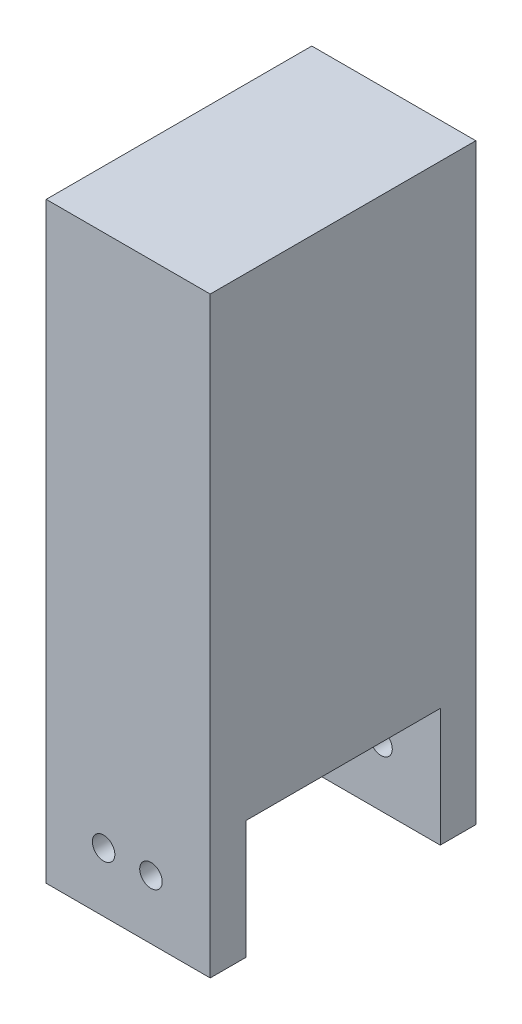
ISO-10303-21;
HEADER;
FILE_DESCRIPTION(('STEP AP214'),'2;1');
FILE_NAME('part.step','',(''),(''),'','','');
FILE_SCHEMA(('AUTOMOTIVE_DESIGN { 1 0 10303 214 1 1 1 1 }'));
ENDSEC;
DATA;
#1=APPLICATION_CONTEXT('core data for automotive mechanical design processes');
#2=APPLICATION_PROTOCOL_DEFINITION('international standard','automotive_design',2000,#1);
#3=PRODUCT_CONTEXT('',#1,'mechanical');
#4=PRODUCT('Part','Part','',(#3));
#5=PRODUCT_RELATED_PRODUCT_CATEGORY('part','',(#4));
#6=PRODUCT_DEFINITION_FORMATION('','',#4);
#7=PRODUCT_DEFINITION_CONTEXT('part definition',#1,'design');
#8=PRODUCT_DEFINITION('design','',#6,#7);
#9=PRODUCT_DEFINITION_SHAPE('','',#8);
#10=(LENGTH_UNIT() NAMED_UNIT(*) SI_UNIT(.MILLI.,.METRE.));
#11=(NAMED_UNIT(*) PLANE_ANGLE_UNIT() SI_UNIT($,.RADIAN.));
#12=(NAMED_UNIT(*) SI_UNIT($,.STERADIAN.) SOLID_ANGLE_UNIT());
#13=UNCERTAINTY_MEASURE_WITH_UNIT(LENGTH_MEASURE(1.E-05),#10,'distance_accuracy_value','');
#14=(GEOMETRIC_REPRESENTATION_CONTEXT(3) GLOBAL_UNCERTAINTY_ASSIGNED_CONTEXT((#13)) GLOBAL_UNIT_ASSIGNED_CONTEXT((#10,
#11,#12)) REPRESENTATION_CONTEXT('',''));
#15=CARTESIAN_POINT('',(0.,0.,0.));
#16=DIRECTION('',(0.,0.,1.));
#17=DIRECTION('',(1.,0.,0.));
#18=AXIS2_PLACEMENT_3D('',#15,#16,#17);
#19=CARTESIAN_POINT('',(0.,0.,0.));
#20=DIRECTION('',(0.,0.,1.));
#21=DIRECTION('',(1.,0.,0.));
#22=AXIS2_PLACEMENT_3D('',#19,#20,#21);
#23=PLANE('',#22);
#24=CARTESIAN_POINT('',(15.0000000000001,5.00000000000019,0.));
#25=DIRECTION('',(0.,0.,1.));
#26=DIRECTION('',(1.,0.,0.));
#27=AXIS2_PLACEMENT_3D('',#24,#25,#26);
#28=CIRCLE('',#27,0.950000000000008);
#29=CARTESIAN_POINT('',(15.9500000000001,5.00000000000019,0.));
#30=VERTEX_POINT('',#29);
#31=EDGE_CURVE('E149',#30,#30,#28,.T.);
#32=ORIENTED_EDGE('',*,*,#31,.T.);
#33=EDGE_LOOP('',(#32));
#34=FACE_BOUND('',#33,.T.);
#35=CARTESIAN_POINT('',(19.0000000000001,5.00000000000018,0.));
#36=DIRECTION('',(0.,0.,1.));
#37=DIRECTION('',(1.,0.,0.));
#38=AXIS2_PLACEMENT_3D('',#35,#36,#37);
#39=CIRCLE('',#38,0.950000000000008);
#40=CARTESIAN_POINT('',(19.9500000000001,5.00000000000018,0.));
#41=VERTEX_POINT('',#40);
#42=EDGE_CURVE('E161',#41,#41,#39,.T.);
#43=ORIENTED_EDGE('',*,*,#42,.T.);
#44=EDGE_LOOP('',(#43));
#45=FACE_BOUND('',#44,.T.);
#46=DIRECTION('',(-1.,0.,0.));
#47=VECTOR('',#46,1.);
#48=CARTESIAN_POINT('',(24.0000000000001,10.0000000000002,0.));
#49=LINE('',#48,#47);
#50=CARTESIAN_POINT('',(24.0000000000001,10.0000000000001,0.));
#51=VERTEX_POINT('',#50);
#52=CARTESIAN_POINT('',(10.1543483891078,10.0000000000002,0.));
#53=VERTEX_POINT('',#52);
#54=EDGE_CURVE('E49',#51,#53,#49,.T.);
#55=ORIENTED_EDGE('',*,*,#54,.F.);
#56=DIRECTION('',(0.,1.,0.));
#57=VECTOR('',#56,1.);
#58=CARTESIAN_POINT('',(24.0000000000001,1.36420711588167E-13,0.));
#59=LINE('',#58,#57);
#60=CARTESIAN_POINT('',(24.0000000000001,1.36420711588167E-13,0.));
#61=VERTEX_POINT('',#60);
#62=EDGE_CURVE('E167',#61,#51,#59,.T.);
#63=ORIENTED_EDGE('',*,*,#62,.F.);
#64=DIRECTION('',(1.,0.,0.));
#65=VECTOR('',#64,1.);
#66=CARTESIAN_POINT('',(24.0000000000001,1.36420711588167E-13,0.));
#67=LINE('',#66,#65);
#68=CARTESIAN_POINT('',(10.1543483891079,1.36420711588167E-13,0.));
#69=VERTEX_POINT('',#68);
#70=EDGE_CURVE('E73',#69,#61,#67,.T.);
#71=ORIENTED_EDGE('',*,*,#70,.F.);
#72=DIRECTION('',(0.,-1.,0.));
#73=VECTOR('',#72,1.);
#74=CARTESIAN_POINT('',(10.1543483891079,1.36420711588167E-13,0.));
#75=LINE('',#74,#73);
#76=EDGE_CURVE('E178',#53,#69,#75,.T.);
#77=ORIENTED_EDGE('',*,*,#76,.F.);
#78=EDGE_LOOP('',(#55,#63,#71,#77));
#79=FACE_BOUND('',#78,.T.);
#80=ADVANCED_FACE('F34',(#34,#45,#79),#23,.F.);
#81=CARTESIAN_POINT('',(0.,0.,3.));
#82=DIRECTION('',(0.,0.,1.));
#83=DIRECTION('',(1.,0.,0.));
#84=AXIS2_PLACEMENT_3D('',#81,#82,#83);
#85=PLANE('',#84);
#86=CARTESIAN_POINT('',(19.0000000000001,5.00000000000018,3.));
#87=DIRECTION('',(0.,0.,1.));
#88=DIRECTION('',(1.,0.,0.));
#89=AXIS2_PLACEMENT_3D('',#86,#87,#88);
#90=CIRCLE('',#89,0.950000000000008);
#91=CARTESIAN_POINT('',(19.9500000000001,5.00000000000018,3.));
#92=VERTEX_POINT('',#91);
#93=EDGE_CURVE('E164',#92,#92,#90,.T.);
#94=ORIENTED_EDGE('',*,*,#93,.F.);
#95=EDGE_LOOP('',(#94));
#96=FACE_BOUND('',#95,.T.);
#97=DIRECTION('',(0.,1.,0.));
#98=VECTOR('',#97,1.);
#99=CARTESIAN_POINT('',(24.0000000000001,1.36420711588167E-13,3.));
#100=LINE('',#99,#98);
#101=CARTESIAN_POINT('',(24.0000000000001,1.36420711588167E-13,3.));
#102=VERTEX_POINT('',#101);
#103=CARTESIAN_POINT('',(24.0000000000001,50.,3.));
#104=VERTEX_POINT('',#103);
#105=EDGE_CURVE('E170',#102,#104,#100,.T.);
#106=ORIENTED_EDGE('',*,*,#105,.T.);
#107=DIRECTION('',(-1.,0.,0.));
#108=VECTOR('',#107,1.);
#109=CARTESIAN_POINT('',(24.0000000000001,50.,3.));
#110=LINE('',#109,#108);
#111=CARTESIAN_POINT('',(10.1543483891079,50.,3.));
#112=VERTEX_POINT('',#111);
#113=EDGE_CURVE('E80',#104,#112,#110,.T.);
#114=ORIENTED_EDGE('',*,*,#113,.T.);
#115=DIRECTION('',(0.,-1.,0.));
#116=VECTOR('',#115,1.);
#117=CARTESIAN_POINT('',(10.1543483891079,1.36420711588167E-13,3.));
#118=LINE('',#117,#116);
#119=CARTESIAN_POINT('',(10.1543483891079,1.36420711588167E-13,3.));
#120=VERTEX_POINT('',#119);
#121=EDGE_CURVE('E173',#112,#120,#118,.T.);
#122=ORIENTED_EDGE('',*,*,#121,.T.);
#123=DIRECTION('',(1.,0.,0.));
#124=VECTOR('',#123,1.);
#125=CARTESIAN_POINT('',(24.0000000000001,1.36420711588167E-13,3.));
#126=LINE('',#125,#124);
#127=EDGE_CURVE('E58',#120,#102,#126,.T.);
#128=ORIENTED_EDGE('',*,*,#127,.T.);
#129=EDGE_LOOP('',(#106,#114,#122,#128));
#130=FACE_BOUND('',#129,.T.);
#131=CARTESIAN_POINT('',(15.0000000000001,5.00000000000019,3.));
#132=DIRECTION('',(0.,0.,1.));
#133=DIRECTION('',(1.,0.,0.));
#134=AXIS2_PLACEMENT_3D('',#131,#132,#133);
#135=CIRCLE('',#134,0.950000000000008);
#136=CARTESIAN_POINT('',(15.9500000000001,5.00000000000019,3.));
#137=VERTEX_POINT('',#136);
#138=EDGE_CURVE('E158',#137,#137,#135,.T.);
#139=ORIENTED_EDGE('',*,*,#138,.F.);
#140=EDGE_LOOP('',(#139));
#141=FACE_BOUND('',#140,.T.);
#142=ADVANCED_FACE('F187',(#96,#130,#141),#85,.T.);
#143=CARTESIAN_POINT('',(24.0000000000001,1.36420711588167E-13,3.));
#144=DIRECTION('',(-1.,0.,0.));
#145=DIRECTION('',(0.,0.,1.));
#146=AXIS2_PLACEMENT_3D('',#143,#144,#145);
#147=PLANE('',#146);
#148=ORIENTED_EDGE('',*,*,#62,.T.);
#149=DIRECTION('',(0.,0.,1.));
#150=VECTOR('',#149,1.);
#151=CARTESIAN_POINT('',(24.0000000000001,10.0000000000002,-19.422));
#152=LINE('',#151,#150);
#153=CARTESIAN_POINT('',(24.0000000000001,10.0000000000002,-16.42));
#154=VERTEX_POINT('',#153);
#155=EDGE_CURVE('E151',#154,#51,#152,.T.);
#156=ORIENTED_EDGE('',*,*,#155,.F.);
#157=DIRECTION('',(0.,1.,0.));
#158=VECTOR('',#157,1.);
#159=CARTESIAN_POINT('',(24.0000000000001,1.36420711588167E-13,-16.42));
#160=LINE('',#159,#158);
#161=CARTESIAN_POINT('',(24.0000000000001,1.36420711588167E-13,-16.42));
#162=VERTEX_POINT('',#161);
#163=EDGE_CURVE('E138',#162,#154,#160,.T.);
#164=ORIENTED_EDGE('',*,*,#163,.F.);
#165=DIRECTION('',(0.,0.,1.));
#166=VECTOR('',#165,1.);
#167=CARTESIAN_POINT('',(24.0000000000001,1.36420711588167E-13,-19.42));
#168=LINE('',#167,#166);
#169=CARTESIAN_POINT('',(24.0000000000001,1.36420711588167E-13,-19.42));
#170=VERTEX_POINT('',#169);
#171=EDGE_CURVE('E124',#170,#162,#168,.T.);
#172=ORIENTED_EDGE('',*,*,#171,.F.);
#173=DIRECTION('',(0.,1.,0.));
#174=VECTOR('',#173,1.);
#175=CARTESIAN_POINT('',(24.0000000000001,1.36420711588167E-13,-19.42));
#176=LINE('',#175,#174);
#177=CARTESIAN_POINT('',(24.0000000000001,50.,-19.42));
#178=VERTEX_POINT('',#177);
#179=EDGE_CURVE('E119',#170,#178,#176,.T.);
#180=ORIENTED_EDGE('',*,*,#179,.T.);
#181=DIRECTION('',(0.,0.,-1.));
#182=VECTOR('',#181,1.);
#183=CARTESIAN_POINT('',(24.0000000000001,50.,3.));
#184=LINE('',#183,#182);
#185=EDGE_CURVE('E11',#104,#178,#184,.T.);
#186=ORIENTED_EDGE('',*,*,#185,.F.);
#187=ORIENTED_EDGE('',*,*,#105,.F.);
#188=DIRECTION('',(0.,0.,-1.));
#189=VECTOR('',#188,1.);
#190=CARTESIAN_POINT('',(24.0000000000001,1.36420711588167E-13,3.));
#191=LINE('',#190,#189);
#192=EDGE_CURVE('E176',#102,#61,#191,.T.);
#193=ORIENTED_EDGE('',*,*,#192,.T.);
#194=EDGE_LOOP('',(#148,#156,#164,#172,#180,#186,#187,#193));
#195=FACE_BOUND('',#194,.T.);
#196=ADVANCED_FACE('F36',(#195),#147,.F.);
#197=CARTESIAN_POINT('',(24.0000000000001,50.,3.));
#198=DIRECTION('',(0.,-1.,0.));
#199=DIRECTION('',(0.,0.,-1.));
#200=AXIS2_PLACEMENT_3D('',#197,#198,#199);
#201=PLANE('',#200);
#202=ORIENTED_EDGE('',*,*,#185,.T.);
#203=DIRECTION('',(-1.,0.,0.));
#204=VECTOR('',#203,1.);
#205=CARTESIAN_POINT('',(24.0000000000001,50.,-19.42));
#206=LINE('',#205,#204);
#207=CARTESIAN_POINT('',(10.1543483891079,50.,-19.42));
#208=VERTEX_POINT('',#207);
#209=EDGE_CURVE('E109',#178,#208,#206,.T.);
#210=ORIENTED_EDGE('',*,*,#209,.T.);
#211=DIRECTION('',(0.,0.,-1.));
#212=VECTOR('',#211,1.);
#213=CARTESIAN_POINT('',(10.1543483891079,50.,3.));
#214=LINE('',#213,#212);
#215=EDGE_CURVE('E42',#112,#208,#214,.T.);
#216=ORIENTED_EDGE('',*,*,#215,.F.);
#217=ORIENTED_EDGE('',*,*,#113,.F.);
#218=EDGE_LOOP('',(#202,#210,#216,#217));
#219=FACE_BOUND('',#218,.T.);
#220=ADVANCED_FACE('F108',(#219),#201,.F.);
#221=CARTESIAN_POINT('',(10.1543483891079,1.36420711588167E-13,3.));
#222=DIRECTION('',(1.,0.,0.));
#223=DIRECTION('',(0.,0.,-1.));
#224=AXIS2_PLACEMENT_3D('',#221,#222,#223);
#225=PLANE('',#224);
#226=ORIENTED_EDGE('',*,*,#215,.T.);
#227=DIRECTION('',(0.,-1.,0.));
#228=VECTOR('',#227,1.);
#229=CARTESIAN_POINT('',(10.1543483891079,1.36420711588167E-13,-19.42));
#230=LINE('',#229,#228);
#231=CARTESIAN_POINT('',(10.1543483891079,1.36420711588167E-13,-19.42));
#232=VERTEX_POINT('',#231);
#233=EDGE_CURVE('E121',#208,#232,#230,.T.);
#234=ORIENTED_EDGE('',*,*,#233,.T.);
#235=DIRECTION('',(0.,0.,1.));
#236=VECTOR('',#235,1.);
#237=CARTESIAN_POINT('',(10.1543483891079,1.36420711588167E-13,-19.42));
#238=LINE('',#237,#236);
#239=CARTESIAN_POINT('',(10.1543483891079,1.36420711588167E-13,-16.42));
#240=VERTEX_POINT('',#239);
#241=EDGE_CURVE('E144',#232,#240,#238,.T.);
#242=ORIENTED_EDGE('',*,*,#241,.T.);
#243=DIRECTION('',(0.,-1.,0.));
#244=VECTOR('',#243,1.);
#245=CARTESIAN_POINT('',(10.1543483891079,1.36420711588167E-13,-16.42));
#246=LINE('',#245,#244);
#247=CARTESIAN_POINT('',(10.1543483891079,10.0000000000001,-16.42));
#248=VERTEX_POINT('',#247);
#249=EDGE_CURVE('E129',#248,#240,#246,.T.);
#250=ORIENTED_EDGE('',*,*,#249,.F.);
#251=DIRECTION('',(0.,0.,1.));
#252=VECTOR('',#251,1.);
#253=CARTESIAN_POINT('',(10.1543483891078,10.0000000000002,-19.422));
#254=LINE('',#253,#252);
#255=EDGE_CURVE('E150',#248,#53,#254,.T.);
#256=ORIENTED_EDGE('',*,*,#255,.T.);
#257=ORIENTED_EDGE('',*,*,#76,.T.);
#258=DIRECTION('',(0.,0.,-1.));
#259=VECTOR('',#258,1.);
#260=CARTESIAN_POINT('',(10.1543483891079,1.36420711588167E-13,3.));
#261=LINE('',#260,#259);
#262=EDGE_CURVE('E182',#120,#69,#261,.T.);
#263=ORIENTED_EDGE('',*,*,#262,.F.);
#264=ORIENTED_EDGE('',*,*,#121,.F.);
#265=EDGE_LOOP('',(#226,#234,#242,#250,#256,#257,#263,#264));
#266=FACE_BOUND('',#265,.T.);
#267=ADVANCED_FACE('F185',(#266),#225,.F.);
#268=CARTESIAN_POINT('',(24.0000000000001,1.36420711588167E-13,3.));
#269=DIRECTION('',(0.,1.,0.));
#270=DIRECTION('',(0.,0.,1.));
#271=AXIS2_PLACEMENT_3D('',#268,#269,#270);
#272=PLANE('',#271);
#273=ORIENTED_EDGE('',*,*,#70,.T.);
#274=ORIENTED_EDGE('',*,*,#192,.F.);
#275=ORIENTED_EDGE('',*,*,#127,.F.);
#276=ORIENTED_EDGE('',*,*,#262,.T.);
#277=EDGE_LOOP('',(#273,#274,#275,#276));
#278=FACE_BOUND('',#277,.T.);
#279=ADVANCED_FACE('F223',(#278),#272,.F.);
#280=CARTESIAN_POINT('',(19.0000000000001,5.00000000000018,3.));
#281=DIRECTION('',(0.,0.,-1.));
#282=DIRECTION('',(-1.,0.,0.));
#283=AXIS2_PLACEMENT_3D('',#280,#281,#282);
#284=CYLINDRICAL_SURFACE('',#283,0.950000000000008);
#285=ORIENTED_EDGE('',*,*,#93,.T.);
#286=EDGE_LOOP('',(#285));
#287=FACE_BOUND('',#286,.T.);
#288=ORIENTED_EDGE('',*,*,#42,.F.);
#289=EDGE_LOOP('',(#288));
#290=FACE_BOUND('',#289,.T.);
#291=ADVANCED_FACE('F226',(#287,#290),#284,.F.);
#292=CARTESIAN_POINT('',(15.0000000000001,5.00000000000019,3.));
#293=DIRECTION('',(0.,0.,-1.));
#294=DIRECTION('',(-1.,0.,0.));
#295=AXIS2_PLACEMENT_3D('',#292,#293,#294);
#296=CYLINDRICAL_SURFACE('',#295,0.950000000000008);
#297=ORIENTED_EDGE('',*,*,#138,.T.);
#298=EDGE_LOOP('',(#297));
#299=FACE_BOUND('',#298,.T.);
#300=ORIENTED_EDGE('',*,*,#31,.F.);
#301=EDGE_LOOP('',(#300));
#302=FACE_BOUND('',#301,.T.);
#303=ADVANCED_FACE('F255',(#299,#302),#296,.F.);
#304=CARTESIAN_POINT('',(24.0000000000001,10.0000000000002,-19.422));
#305=DIRECTION('',(0.,1.,0.));
#306=DIRECTION('',(0.,0.,1.));
#307=AXIS2_PLACEMENT_3D('',#304,#305,#306);
#308=PLANE('',#307);
#309=DIRECTION('',(-1.,0.,0.));
#310=VECTOR('',#309,1.);
#311=CARTESIAN_POINT('',(24.0000000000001,10.0000000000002,-16.42));
#312=LINE('',#311,#310);
#313=EDGE_CURVE('E147',#154,#248,#312,.T.);
#314=ORIENTED_EDGE('',*,*,#313,.F.);
#315=ORIENTED_EDGE('',*,*,#155,.T.);
#316=ORIENTED_EDGE('',*,*,#54,.T.);
#317=ORIENTED_EDGE('',*,*,#255,.F.);
#318=EDGE_LOOP('',(#314,#315,#316,#317));
#319=FACE_BOUND('',#318,.T.);
#320=ADVANCED_FACE('F192',(#319),#308,.F.);
#321=CARTESIAN_POINT('',(0.,0.,-16.42));
#322=DIRECTION('',(0.,0.,-1.));
#323=DIRECTION('',(1.,0.,0.));
#324=AXIS2_PLACEMENT_3D('',#321,#322,#323);
#325=PLANE('',#324);
#326=CARTESIAN_POINT('',(19.0000000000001,5.00000000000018,-16.42));
#327=DIRECTION('',(0.,0.,1.));
#328=DIRECTION('',(1.,0.,0.));
#329=AXIS2_PLACEMENT_3D('',#326,#327,#328);
#330=CIRCLE('',#329,0.950000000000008);
#331=CARTESIAN_POINT('',(19.9500000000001,5.00000000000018,-16.42));
#332=VERTEX_POINT('',#331);
#333=EDGE_CURVE('E132',#332,#332,#330,.T.);
#334=ORIENTED_EDGE('',*,*,#333,.F.);
#335=EDGE_LOOP('',(#334));
#336=FACE_BOUND('',#335,.T.);
#337=CARTESIAN_POINT('',(15.0000000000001,5.00000000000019,-16.42));
#338=DIRECTION('',(0.,0.,1.));
#339=DIRECTION('',(1.,0.,0.));
#340=AXIS2_PLACEMENT_3D('',#337,#338,#339);
#341=CIRCLE('',#340,0.950000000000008);
#342=CARTESIAN_POINT('',(15.9500000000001,5.00000000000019,-16.42));
#343=VERTEX_POINT('',#342);
#344=EDGE_CURVE('E346',#343,#343,#341,.T.);
#345=ORIENTED_EDGE('',*,*,#344,.F.);
#346=EDGE_LOOP('',(#345));
#347=FACE_BOUND('',#346,.T.);
#348=ORIENTED_EDGE('',*,*,#163,.T.);
#349=ORIENTED_EDGE('',*,*,#313,.T.);
#350=ORIENTED_EDGE('',*,*,#249,.T.);
#351=DIRECTION('',(1.,0.,0.));
#352=VECTOR('',#351,1.);
#353=CARTESIAN_POINT('',(24.0000000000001,1.36420711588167E-13,-16.42));
#354=LINE('',#353,#352);
#355=EDGE_CURVE('E126',#240,#162,#354,.T.);
#356=ORIENTED_EDGE('',*,*,#355,.T.);
#357=EDGE_LOOP('',(#348,#349,#350,#356));
#358=FACE_BOUND('',#357,.T.);
#359=ADVANCED_FACE('F194',(#336,#347,#358),#325,.F.);
#360=CARTESIAN_POINT('',(0.,0.,-19.42));
#361=DIRECTION('',(0.,0.,-1.));
#362=DIRECTION('',(1.,0.,0.));
#363=AXIS2_PLACEMENT_3D('',#360,#361,#362);
#364=PLANE('',#363);
#365=CARTESIAN_POINT('',(19.0000000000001,5.00000000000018,-19.42));
#366=DIRECTION('',(0.,0.,1.));
#367=DIRECTION('',(1.,0.,0.));
#368=AXIS2_PLACEMENT_3D('',#365,#366,#367);
#369=CIRCLE('',#368,0.950000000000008);
#370=CARTESIAN_POINT('',(19.9500000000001,5.00000000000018,-19.42));
#371=VERTEX_POINT('',#370);
#372=EDGE_CURVE('E141',#371,#371,#369,.T.);
#373=ORIENTED_EDGE('',*,*,#372,.T.);
#374=EDGE_LOOP('',(#373));
#375=FACE_BOUND('',#374,.T.);
#376=ORIENTED_EDGE('',*,*,#179,.F.);
#377=DIRECTION('',(1.,0.,0.));
#378=VECTOR('',#377,1.);
#379=CARTESIAN_POINT('',(24.0000000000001,1.36420711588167E-13,-19.42));
#380=LINE('',#379,#378);
#381=EDGE_CURVE('E136',#232,#170,#380,.T.);
#382=ORIENTED_EDGE('',*,*,#381,.F.);
#383=ORIENTED_EDGE('',*,*,#233,.F.);
#384=ORIENTED_EDGE('',*,*,#209,.F.);
#385=EDGE_LOOP('',(#376,#382,#383,#384));
#386=FACE_BOUND('',#385,.T.);
#387=CARTESIAN_POINT('',(15.0000000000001,5.00000000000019,-19.42));
#388=DIRECTION('',(0.,0.,1.));
#389=DIRECTION('',(1.,0.,0.));
#390=AXIS2_PLACEMENT_3D('',#387,#388,#389);
#391=CIRCLE('',#390,0.950000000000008);
#392=CARTESIAN_POINT('',(15.9500000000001,5.00000000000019,-19.42));
#393=VERTEX_POINT('',#392);
#394=EDGE_CURVE('E343',#393,#393,#391,.T.);
#395=ORIENTED_EDGE('',*,*,#394,.T.);
#396=EDGE_LOOP('',(#395));
#397=FACE_BOUND('',#396,.T.);
#398=ADVANCED_FACE('F116',(#375,#386,#397),#364,.T.);
#399=CARTESIAN_POINT('',(24.0000000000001,1.36420711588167E-13,-19.42));
#400=DIRECTION('',(0.,1.,0.));
#401=DIRECTION('',(0.,0.,-1.));
#402=AXIS2_PLACEMENT_3D('',#399,#400,#401);
#403=PLANE('',#402);
#404=ORIENTED_EDGE('',*,*,#355,.F.);
#405=ORIENTED_EDGE('',*,*,#241,.F.);
#406=ORIENTED_EDGE('',*,*,#381,.T.);
#407=ORIENTED_EDGE('',*,*,#171,.T.);
#408=EDGE_LOOP('',(#404,#405,#406,#407));
#409=FACE_BOUND('',#408,.T.);
#410=ADVANCED_FACE('F197',(#409),#403,.F.);
#411=CARTESIAN_POINT('',(19.0000000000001,5.00000000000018,-19.42));
#412=DIRECTION('',(0.,0.,1.));
#413=DIRECTION('',(-1.,0.,0.));
#414=AXIS2_PLACEMENT_3D('',#411,#412,#413);
#415=CYLINDRICAL_SURFACE('',#414,0.950000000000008);
#416=ORIENTED_EDGE('',*,*,#372,.F.);
#417=EDGE_LOOP('',(#416));
#418=FACE_BOUND('',#417,.T.);
#419=ORIENTED_EDGE('',*,*,#333,.T.);
#420=EDGE_LOOP('',(#419));
#421=FACE_BOUND('',#420,.T.);
#422=ADVANCED_FACE('F199',(#418,#421),#415,.F.);
#423=CARTESIAN_POINT('',(15.0000000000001,5.00000000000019,-19.42));
#424=DIRECTION('',(0.,0.,1.));
#425=DIRECTION('',(-1.,0.,0.));
#426=AXIS2_PLACEMENT_3D('',#423,#424,#425);
#427=CYLINDRICAL_SURFACE('',#426,0.950000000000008);
#428=ORIENTED_EDGE('',*,*,#394,.F.);
#429=EDGE_LOOP('',(#428));
#430=FACE_BOUND('',#429,.T.);
#431=ORIENTED_EDGE('',*,*,#344,.T.);
#432=EDGE_LOOP('',(#431));
#433=FACE_BOUND('',#432,.T.);
#434=ADVANCED_FACE('F205',(#430,#433),#427,.F.);
#435=CLOSED_SHELL('',(#80,#142,#196,#220,#267,#279,#291,#303,#320,#359,#398,#410,#422,#434));
#436=MANIFOLD_SOLID_BREP('B2',#435);
#437=ADVANCED_BREP_SHAPE_REPRESENTATION('',(#18,#436),#14);
#438=SHAPE_DEFINITION_REPRESENTATION(#9,#437);
ENDSEC;
END-ISO-10303-21;
